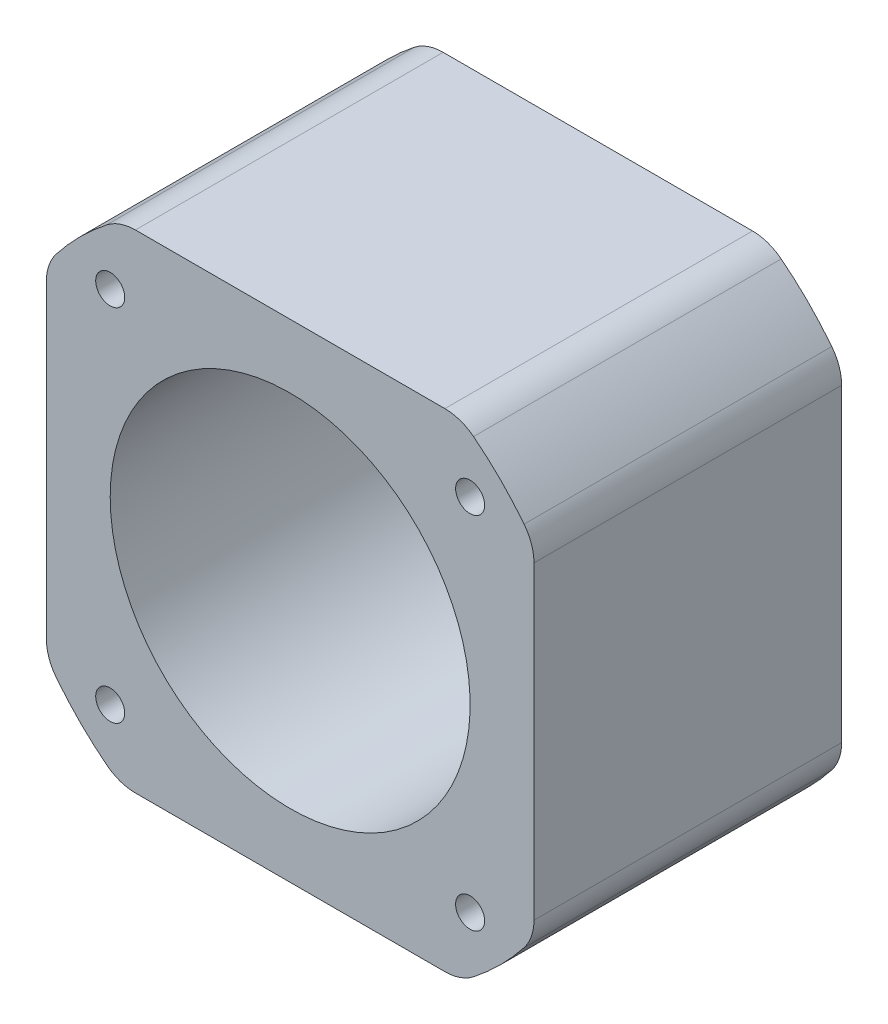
ISO-10303-21;
HEADER;
FILE_DESCRIPTION(('STEP AP214'),'2;1');
FILE_NAME('part.step','',(''),(''),'','','');
FILE_SCHEMA(('AUTOMOTIVE_DESIGN { 1 0 10303 214 1 1 1 1 }'));
ENDSEC;
DATA;
#1=APPLICATION_CONTEXT('core data for automotive mechanical design processes');
#2=APPLICATION_PROTOCOL_DEFINITION('international standard','automotive_design',2000,#1);
#3=PRODUCT_CONTEXT('',#1,'mechanical');
#4=PRODUCT('Part','Part','',(#3));
#5=PRODUCT_RELATED_PRODUCT_CATEGORY('part','',(#4));
#6=PRODUCT_DEFINITION_FORMATION('','',#4);
#7=PRODUCT_DEFINITION_CONTEXT('part definition',#1,'design');
#8=PRODUCT_DEFINITION('design','',#6,#7);
#9=PRODUCT_DEFINITION_SHAPE('','',#8);
#10=(LENGTH_UNIT() NAMED_UNIT(*) SI_UNIT(.MILLI.,.METRE.));
#11=(NAMED_UNIT(*) PLANE_ANGLE_UNIT() SI_UNIT($,.RADIAN.));
#12=(NAMED_UNIT(*) SI_UNIT($,.STERADIAN.) SOLID_ANGLE_UNIT());
#13=UNCERTAINTY_MEASURE_WITH_UNIT(LENGTH_MEASURE(1.E-05),#10,'distance_accuracy_value','');
#14=(GEOMETRIC_REPRESENTATION_CONTEXT(3) GLOBAL_UNCERTAINTY_ASSIGNED_CONTEXT((#13)) GLOBAL_UNIT_ASSIGNED_CONTEXT((#10,
#11,#12)) REPRESENTATION_CONTEXT('',''));
#15=CARTESIAN_POINT('',(0.,0.,0.));
#16=DIRECTION('',(0.,0.,1.));
#17=DIRECTION('',(1.,0.,0.));
#18=AXIS2_PLACEMENT_3D('',#15,#16,#17);
#19=CARTESIAN_POINT('',(-23.7206667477,121.617151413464,7.69999999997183));
#20=DIRECTION('',(0.,0.,1.));
#21=DIRECTION('',(1.,0.,0.));
#22=AXIS2_PLACEMENT_3D('',#19,#20,#21);
#23=CYLINDRICAL_SURFACE('',#22,4.00000000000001);
#24=CARTESIAN_POINT('',(-23.7206667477,121.617151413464,34.1999999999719));
#25=DIRECTION('',(0.,0.,1.));
#26=DIRECTION('',(1.,0.,0.));
#27=AXIS2_PLACEMENT_3D('',#24,#25,#26);
#28=CIRCLE('',#27,4.00000000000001);
#29=CARTESIAN_POINT('',(-23.7206667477,125.617151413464,34.1999999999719));
#30=VERTEX_POINT('',#29);
#31=CARTESIAN_POINT('',(-26.1882897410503,124.765299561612,34.1999999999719));
#32=VERTEX_POINT('',#31);
#33=EDGE_CURVE('E178',#30,#32,#28,.T.);
#34=ORIENTED_EDGE('',*,*,#33,.F.);
#35=DIRECTION('',(0.,0.,1.));
#36=VECTOR('',#35,1.);
#37=CARTESIAN_POINT('',(-23.7206667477,125.617151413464,7.69999999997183));
#38=LINE('',#37,#36);
#39=CARTESIAN_POINT('',(-23.7206667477,125.617151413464,7.69999999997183));
#40=VERTEX_POINT('',#39);
#41=EDGE_CURVE('E11',#40,#30,#38,.T.);
#42=ORIENTED_EDGE('',*,*,#41,.F.);
#43=CARTESIAN_POINT('',(-23.7206667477,121.617151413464,7.69999999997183));
#44=DIRECTION('',(0.,0.,1.));
#45=DIRECTION('',(1.,0.,0.));
#46=AXIS2_PLACEMENT_3D('',#43,#44,#45);
#47=CIRCLE('',#46,4.00000000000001);
#48=CARTESIAN_POINT('',(-26.1882897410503,124.765299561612,7.69999999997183));
#49=VERTEX_POINT('',#48);
#50=EDGE_CURVE('E223',#40,#49,#47,.T.);
#51=ORIENTED_EDGE('',*,*,#50,.T.);
#52=DIRECTION('',(0.,0.,1.));
#53=VECTOR('',#52,1.);
#54=CARTESIAN_POINT('',(-26.1882897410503,124.765299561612,7.69999999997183));
#55=LINE('',#54,#53);
#56=EDGE_CURVE('E36',#49,#32,#55,.T.);
#57=ORIENTED_EDGE('',*,*,#56,.T.);
#58=EDGE_LOOP('',(#34,#42,#51,#57));
#59=FACE_BOUND('',#58,.T.);
#60=ADVANCED_FACE('F33',(#59),#23,.T.);
#61=CARTESIAN_POINT('',(2.92966158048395,125.617151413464,7.69999999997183));
#62=DIRECTION('',(0.,1.,0.));
#63=DIRECTION('',(0.,0.,1.));
#64=AXIS2_PLACEMENT_3D('',#61,#62,#63);
#65=PLANE('',#64);
#66=DIRECTION('',(-1.,0.,0.));
#67=VECTOR('',#66,1.);
#68=CARTESIAN_POINT('',(2.92966158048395,125.617151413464,34.1999999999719));
#69=LINE('',#68,#67);
#70=CARTESIAN_POINT('',(2.92966158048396,125.617151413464,34.1999999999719));
#71=VERTEX_POINT('',#70);
#72=EDGE_CURVE('E221',#71,#30,#69,.T.);
#73=ORIENTED_EDGE('',*,*,#72,.F.);
#74=DIRECTION('',(0.,0.,1.));
#75=VECTOR('',#74,1.);
#76=CARTESIAN_POINT('',(2.92966158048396,125.617151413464,7.69999999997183));
#77=LINE('',#76,#75);
#78=CARTESIAN_POINT('',(2.92966158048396,125.617151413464,7.69999999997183));
#79=VERTEX_POINT('',#78);
#80=EDGE_CURVE('E42',#79,#71,#77,.T.);
#81=ORIENTED_EDGE('',*,*,#80,.F.);
#82=DIRECTION('',(-1.,0.,0.));
#83=VECTOR('',#82,1.);
#84=CARTESIAN_POINT('',(2.92966158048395,125.617151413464,7.69999999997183));
#85=LINE('',#84,#83);
#86=EDGE_CURVE('E168',#79,#40,#85,.T.);
#87=ORIENTED_EDGE('',*,*,#86,.T.);
#88=ORIENTED_EDGE('',*,*,#41,.T.);
#89=EDGE_LOOP('',(#73,#81,#87,#88));
#90=FACE_BOUND('',#89,.T.);
#91=ADVANCED_FACE('F251',(#90),#65,.T.);
#92=CARTESIAN_POINT('',(2.92966158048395,121.617151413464,7.69999999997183));
#93=DIRECTION('',(0.,0.,1.));
#94=DIRECTION('',(1.,0.,0.));
#95=AXIS2_PLACEMENT_3D('',#92,#93,#94);
#96=CYLINDRICAL_SURFACE('',#95,4.00000000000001);
#97=CARTESIAN_POINT('',(2.92966158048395,121.617151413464,34.1999999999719));
#98=DIRECTION('',(0.,0.,1.));
#99=DIRECTION('',(1.,0.,0.));
#100=AXIS2_PLACEMENT_3D('',#97,#98,#99);
#101=CIRCLE('',#100,4.00000000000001);
#102=CARTESIAN_POINT('',(5.39728457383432,124.765299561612,34.1999999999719));
#103=VERTEX_POINT('',#102);
#104=EDGE_CURVE('E155',#103,#71,#101,.T.);
#105=ORIENTED_EDGE('',*,*,#104,.F.);
#106=DIRECTION('',(0.,0.,1.));
#107=VECTOR('',#106,1.);
#108=CARTESIAN_POINT('',(5.39728457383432,124.765299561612,7.69999999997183));
#109=LINE('',#108,#107);
#110=CARTESIAN_POINT('',(5.39728457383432,124.765299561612,7.69999999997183));
#111=VERTEX_POINT('',#110);
#112=EDGE_CURVE('E150',#111,#103,#109,.T.);
#113=ORIENTED_EDGE('',*,*,#112,.F.);
#114=CARTESIAN_POINT('',(2.92966158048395,121.617151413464,7.69999999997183));
#115=DIRECTION('',(0.,0.,1.));
#116=DIRECTION('',(1.,0.,0.));
#117=AXIS2_PLACEMENT_3D('',#114,#115,#116);
#118=CIRCLE('',#117,4.00000000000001);
#119=EDGE_CURVE('E153',#111,#79,#118,.T.);
#120=ORIENTED_EDGE('',*,*,#119,.T.);
#121=ORIENTED_EDGE('',*,*,#80,.T.);
#122=EDGE_LOOP('',(#105,#113,#120,#121));
#123=FACE_BOUND('',#122,.T.);
#124=ADVANCED_FACE('F152',(#123),#96,.T.);
#125=CARTESIAN_POINT('',(-10.395502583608,104.617151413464,7.69999999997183));
#126=DIRECTION('',(0.,0.,1.));
#127=DIRECTION('',(1.,0.,0.));
#128=AXIS2_PLACEMENT_3D('',#125,#126,#127);
#129=CYLINDRICAL_SURFACE('',#128,25.6000000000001);
#130=CARTESIAN_POINT('',(-10.395502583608,104.617151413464,34.1999999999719));
#131=DIRECTION('',(0.,0.,1.));
#132=DIRECTION('',(1.,0.,0.));
#133=AXIS2_PLACEMENT_3D('',#130,#131,#132);
#134=CIRCLE('',#133,25.6000000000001);
#135=CARTESIAN_POINT('',(9.75264556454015,120.409938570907,34.1999999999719));
#136=VERTEX_POINT('',#135);
#137=EDGE_CURVE('E218',#136,#103,#134,.T.);
#138=ORIENTED_EDGE('',*,*,#137,.F.);
#139=DIRECTION('',(0.,0.,1.));
#140=VECTOR('',#139,1.);
#141=CARTESIAN_POINT('',(9.75264556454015,120.409938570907,7.69999999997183));
#142=LINE('',#141,#140);
#143=CARTESIAN_POINT('',(9.75264556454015,120.409938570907,7.69999999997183));
#144=VERTEX_POINT('',#143);
#145=EDGE_CURVE('E160',#144,#136,#142,.T.);
#146=ORIENTED_EDGE('',*,*,#145,.F.);
#147=CARTESIAN_POINT('',(-10.395502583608,104.617151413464,7.69999999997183));
#148=DIRECTION('',(0.,0.,1.));
#149=DIRECTION('',(1.,0.,0.));
#150=AXIS2_PLACEMENT_3D('',#147,#148,#149);
#151=CIRCLE('',#150,25.6000000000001);
#152=EDGE_CURVE('E166',#144,#111,#151,.T.);
#153=ORIENTED_EDGE('',*,*,#152,.T.);
#154=ORIENTED_EDGE('',*,*,#112,.T.);
#155=EDGE_LOOP('',(#138,#146,#153,#154));
#156=FACE_BOUND('',#155,.T.);
#157=ADVANCED_FACE('F170',(#156),#129,.T.);
#158=CARTESIAN_POINT('',(6.60449741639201,117.942315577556,7.69999999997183));
#159=DIRECTION('',(0.,0.,1.));
#160=DIRECTION('',(1.,0.,0.));
#161=AXIS2_PLACEMENT_3D('',#158,#159,#160);
#162=CYLINDRICAL_SURFACE('',#161,4.00000000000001);
#163=CARTESIAN_POINT('',(6.60449741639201,117.942315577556,34.1999999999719));
#164=DIRECTION('',(0.,0.,1.));
#165=DIRECTION('',(1.,0.,0.));
#166=AXIS2_PLACEMENT_3D('',#163,#164,#165);
#167=CIRCLE('',#166,4.00000000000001);
#168=CARTESIAN_POINT('',(10.604497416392,117.942315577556,34.1999999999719));
#169=VERTEX_POINT('',#168);
#170=EDGE_CURVE('E215',#169,#136,#167,.T.);
#171=ORIENTED_EDGE('',*,*,#170,.F.);
#172=DIRECTION('',(0.,0.,1.));
#173=VECTOR('',#172,1.);
#174=CARTESIAN_POINT('',(10.604497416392,117.942315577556,7.69999999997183));
#175=LINE('',#174,#173);
#176=CARTESIAN_POINT('',(10.604497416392,117.942315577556,7.69999999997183));
#177=VERTEX_POINT('',#176);
#178=EDGE_CURVE('E227',#177,#169,#175,.T.);
#179=ORIENTED_EDGE('',*,*,#178,.F.);
#180=CARTESIAN_POINT('',(6.60449741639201,117.942315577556,7.69999999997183));
#181=DIRECTION('',(0.,0.,1.));
#182=DIRECTION('',(1.,0.,0.));
#183=AXIS2_PLACEMENT_3D('',#180,#181,#182);
#184=CIRCLE('',#183,4.00000000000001);
#185=EDGE_CURVE('E171',#177,#144,#184,.T.);
#186=ORIENTED_EDGE('',*,*,#185,.T.);
#187=ORIENTED_EDGE('',*,*,#145,.T.);
#188=EDGE_LOOP('',(#171,#179,#186,#187));
#189=FACE_BOUND('',#188,.T.);
#190=ADVANCED_FACE('F264',(#189),#162,.T.);
#191=CARTESIAN_POINT('',(10.604497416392,91.2919872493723,7.69999999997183));
#192=DIRECTION('',(1.,0.,0.));
#193=DIRECTION('',(0.,0.,-1.));
#194=AXIS2_PLACEMENT_3D('',#191,#192,#193);
#195=PLANE('',#194);
#196=DIRECTION('',(0.,1.,0.));
#197=VECTOR('',#196,1.);
#198=CARTESIAN_POINT('',(10.604497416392,91.2919872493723,34.1999999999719));
#199=LINE('',#198,#197);
#200=CARTESIAN_POINT('',(10.604497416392,91.2919872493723,34.1999999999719));
#201=VERTEX_POINT('',#200);
#202=EDGE_CURVE('E212',#201,#169,#199,.T.);
#203=ORIENTED_EDGE('',*,*,#202,.F.);
#204=DIRECTION('',(0.,0.,1.));
#205=VECTOR('',#204,1.);
#206=CARTESIAN_POINT('',(10.604497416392,91.2919872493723,7.69999999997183));
#207=LINE('',#206,#205);
#208=CARTESIAN_POINT('',(10.604497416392,91.2919872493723,7.69999999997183));
#209=VERTEX_POINT('',#208);
#210=EDGE_CURVE('E229',#209,#201,#207,.T.);
#211=ORIENTED_EDGE('',*,*,#210,.F.);
#212=DIRECTION('',(0.,1.,0.));
#213=VECTOR('',#212,1.);
#214=CARTESIAN_POINT('',(10.604497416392,91.2919872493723,7.69999999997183));
#215=LINE('',#214,#213);
#216=EDGE_CURVE('E173',#209,#177,#215,.T.);
#217=ORIENTED_EDGE('',*,*,#216,.T.);
#218=ORIENTED_EDGE('',*,*,#178,.T.);
#219=EDGE_LOOP('',(#203,#211,#217,#218));
#220=FACE_BOUND('',#219,.T.);
#221=ADVANCED_FACE('F267',(#220),#195,.T.);
#222=CARTESIAN_POINT('',(6.60449741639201,91.2919872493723,7.69999999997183));
#223=DIRECTION('',(0.,0.,1.));
#224=DIRECTION('',(1.,0.,0.));
#225=AXIS2_PLACEMENT_3D('',#222,#223,#224);
#226=CYLINDRICAL_SURFACE('',#225,3.99999999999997);
#227=CARTESIAN_POINT('',(6.60449741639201,91.2919872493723,34.1999999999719));
#228=DIRECTION('',(0.,0.,1.));
#229=DIRECTION('',(1.,0.,0.));
#230=AXIS2_PLACEMENT_3D('',#227,#228,#229);
#231=CIRCLE('',#230,3.99999999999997);
#232=CARTESIAN_POINT('',(9.75264556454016,88.824364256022,34.1999999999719));
#233=VERTEX_POINT('',#232);
#234=EDGE_CURVE('E209',#233,#201,#231,.T.);
#235=ORIENTED_EDGE('',*,*,#234,.F.);
#236=DIRECTION('',(0.,0.,1.));
#237=VECTOR('',#236,1.);
#238=CARTESIAN_POINT('',(9.75264556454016,88.824364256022,7.69999999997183));
#239=LINE('',#238,#237);
#240=CARTESIAN_POINT('',(9.75264556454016,88.824364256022,7.69999999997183));
#241=VERTEX_POINT('',#240);
#242=EDGE_CURVE('E231',#241,#233,#239,.T.);
#243=ORIENTED_EDGE('',*,*,#242,.F.);
#244=CARTESIAN_POINT('',(6.60449741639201,91.2919872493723,7.69999999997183));
#245=DIRECTION('',(0.,0.,1.));
#246=DIRECTION('',(1.,0.,0.));
#247=AXIS2_PLACEMENT_3D('',#244,#245,#246);
#248=CIRCLE('',#247,3.99999999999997);
#249=EDGE_CURVE('E399',#241,#209,#248,.T.);
#250=ORIENTED_EDGE('',*,*,#249,.T.);
#251=ORIENTED_EDGE('',*,*,#210,.T.);
#252=EDGE_LOOP('',(#235,#243,#250,#251));
#253=FACE_BOUND('',#252,.T.);
#254=ADVANCED_FACE('F271',(#253),#226,.T.);
#255=CARTESIAN_POINT('',(-10.395502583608,104.617151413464,7.69999999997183));
#256=DIRECTION('',(0.,0.,1.));
#257=DIRECTION('',(1.,0.,0.));
#258=AXIS2_PLACEMENT_3D('',#255,#256,#257);
#259=CYLINDRICAL_SURFACE('',#258,25.6);
#260=CARTESIAN_POINT('',(-10.395502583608,104.617151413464,34.1999999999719));
#261=DIRECTION('',(0.,0.,1.));
#262=DIRECTION('',(1.,0.,0.));
#263=AXIS2_PLACEMENT_3D('',#260,#261,#262);
#264=CIRCLE('',#263,25.6);
#265=CARTESIAN_POINT('',(5.39728457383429,84.4690032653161,34.1999999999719));
#266=VERTEX_POINT('',#265);
#267=EDGE_CURVE('E206',#266,#233,#264,.T.);
#268=ORIENTED_EDGE('',*,*,#267,.F.);
#269=DIRECTION('',(0.,0.,1.));
#270=VECTOR('',#269,1.);
#271=CARTESIAN_POINT('',(5.39728457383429,84.4690032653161,7.69999999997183));
#272=LINE('',#271,#270);
#273=CARTESIAN_POINT('',(5.39728457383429,84.4690032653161,7.69999999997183));
#274=VERTEX_POINT('',#273);
#275=EDGE_CURVE('E233',#274,#266,#272,.T.);
#276=ORIENTED_EDGE('',*,*,#275,.F.);
#277=CARTESIAN_POINT('',(-10.395502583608,104.617151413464,7.69999999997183));
#278=DIRECTION('',(0.,0.,1.));
#279=DIRECTION('',(1.,0.,0.));
#280=AXIS2_PLACEMENT_3D('',#277,#278,#279);
#281=CIRCLE('',#280,25.6);
#282=EDGE_CURVE('E396',#274,#241,#281,.T.);
#283=ORIENTED_EDGE('',*,*,#282,.T.);
#284=ORIENTED_EDGE('',*,*,#242,.T.);
#285=EDGE_LOOP('',(#268,#276,#283,#284));
#286=FACE_BOUND('',#285,.T.);
#287=ADVANCED_FACE('F275',(#286),#259,.T.);
#288=CARTESIAN_POINT('',(2.92966158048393,87.6171514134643,7.69999999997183));
#289=DIRECTION('',(0.,0.,1.));
#290=DIRECTION('',(1.,0.,0.));
#291=AXIS2_PLACEMENT_3D('',#288,#289,#290);
#292=CYLINDRICAL_SURFACE('',#291,4.00000000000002);
#293=CARTESIAN_POINT('',(2.92966158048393,87.6171514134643,34.1999999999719));
#294=DIRECTION('',(0.,0.,1.));
#295=DIRECTION('',(1.,0.,0.));
#296=AXIS2_PLACEMENT_3D('',#293,#294,#295);
#297=CIRCLE('',#296,4.00000000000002);
#298=CARTESIAN_POINT('',(2.92966158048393,83.6171514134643,34.1999999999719));
#299=VERTEX_POINT('',#298);
#300=EDGE_CURVE('E203',#299,#266,#297,.T.);
#301=ORIENTED_EDGE('',*,*,#300,.F.);
#302=DIRECTION('',(0.,0.,1.));
#303=VECTOR('',#302,1.);
#304=CARTESIAN_POINT('',(2.92966158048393,83.6171514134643,7.69999999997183));
#305=LINE('',#304,#303);
#306=CARTESIAN_POINT('',(2.92966158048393,83.6171514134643,7.69999999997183));
#307=VERTEX_POINT('',#306);
#308=EDGE_CURVE('E235',#307,#299,#305,.T.);
#309=ORIENTED_EDGE('',*,*,#308,.F.);
#310=CARTESIAN_POINT('',(2.92966158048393,87.6171514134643,7.69999999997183));
#311=DIRECTION('',(0.,0.,1.));
#312=DIRECTION('',(1.,0.,0.));
#313=AXIS2_PLACEMENT_3D('',#310,#311,#312);
#314=CIRCLE('',#313,4.00000000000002);
#315=EDGE_CURVE('E393',#307,#274,#314,.T.);
#316=ORIENTED_EDGE('',*,*,#315,.T.);
#317=ORIENTED_EDGE('',*,*,#275,.T.);
#318=EDGE_LOOP('',(#301,#309,#316,#317));
#319=FACE_BOUND('',#318,.T.);
#320=ADVANCED_FACE('F279',(#319),#292,.T.);
#321=CARTESIAN_POINT('',(-23.7206667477,83.6171514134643,7.69999999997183));
#322=DIRECTION('',(0.,-1.,0.));
#323=DIRECTION('',(0.,0.,-1.));
#324=AXIS2_PLACEMENT_3D('',#321,#322,#323);
#325=PLANE('',#324);
#326=DIRECTION('',(1.,0.,0.));
#327=VECTOR('',#326,1.);
#328=CARTESIAN_POINT('',(-23.7206667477,83.6171514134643,34.1999999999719));
#329=LINE('',#328,#327);
#330=CARTESIAN_POINT('',(-23.7206667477,83.6171514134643,34.1999999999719));
#331=VERTEX_POINT('',#330);
#332=EDGE_CURVE('E200',#331,#299,#329,.T.);
#333=ORIENTED_EDGE('',*,*,#332,.F.);
#334=DIRECTION('',(0.,0.,1.));
#335=VECTOR('',#334,1.);
#336=CARTESIAN_POINT('',(-23.7206667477,83.6171514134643,7.69999999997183));
#337=LINE('',#336,#335);
#338=CARTESIAN_POINT('',(-23.7206667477,83.6171514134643,7.69999999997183));
#339=VERTEX_POINT('',#338);
#340=EDGE_CURVE('E237',#339,#331,#337,.T.);
#341=ORIENTED_EDGE('',*,*,#340,.F.);
#342=DIRECTION('',(1.,0.,0.));
#343=VECTOR('',#342,1.);
#344=CARTESIAN_POINT('',(-23.7206667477,83.6171514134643,7.69999999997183));
#345=LINE('',#344,#343);
#346=EDGE_CURVE('E390',#339,#307,#345,.T.);
#347=ORIENTED_EDGE('',*,*,#346,.T.);
#348=ORIENTED_EDGE('',*,*,#308,.T.);
#349=EDGE_LOOP('',(#333,#341,#347,#348));
#350=FACE_BOUND('',#349,.T.);
#351=ADVANCED_FACE('F283',(#350),#325,.T.);
#352=CARTESIAN_POINT('',(-23.7206667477,87.6171514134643,7.69999999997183));
#353=DIRECTION('',(0.,0.,1.));
#354=DIRECTION('',(1.,0.,0.));
#355=AXIS2_PLACEMENT_3D('',#352,#353,#354);
#356=CYLINDRICAL_SURFACE('',#355,4.00000000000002);
#357=CARTESIAN_POINT('',(-23.7206667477,87.6171514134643,34.1999999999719));
#358=DIRECTION('',(0.,0.,1.));
#359=DIRECTION('',(1.,0.,0.));
#360=AXIS2_PLACEMENT_3D('',#357,#358,#359);
#361=CIRCLE('',#360,4.00000000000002);
#362=CARTESIAN_POINT('',(-26.1882897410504,84.4690032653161,34.1999999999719));
#363=VERTEX_POINT('',#362);
#364=EDGE_CURVE('E197',#363,#331,#361,.T.);
#365=ORIENTED_EDGE('',*,*,#364,.F.);
#366=DIRECTION('',(0.,0.,1.));
#367=VECTOR('',#366,1.);
#368=CARTESIAN_POINT('',(-26.1882897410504,84.4690032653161,7.69999999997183));
#369=LINE('',#368,#367);
#370=CARTESIAN_POINT('',(-26.1882897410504,84.4690032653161,7.69999999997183));
#371=VERTEX_POINT('',#370);
#372=EDGE_CURVE('E239',#371,#363,#369,.T.);
#373=ORIENTED_EDGE('',*,*,#372,.F.);
#374=CARTESIAN_POINT('',(-23.7206667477,87.6171514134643,7.69999999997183));
#375=DIRECTION('',(0.,0.,1.));
#376=DIRECTION('',(1.,0.,0.));
#377=AXIS2_PLACEMENT_3D('',#374,#375,#376);
#378=CIRCLE('',#377,4.00000000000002);
#379=EDGE_CURVE('E387',#371,#339,#378,.T.);
#380=ORIENTED_EDGE('',*,*,#379,.T.);
#381=ORIENTED_EDGE('',*,*,#340,.T.);
#382=EDGE_LOOP('',(#365,#373,#380,#381));
#383=FACE_BOUND('',#382,.T.);
#384=ADVANCED_FACE('F287',(#383),#356,.T.);
#385=CARTESIAN_POINT('',(-10.395502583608,104.617151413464,7.69999999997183));
#386=DIRECTION('',(0.,0.,1.));
#387=DIRECTION('',(1.,0.,0.));
#388=AXIS2_PLACEMENT_3D('',#385,#386,#387);
#389=CYLINDRICAL_SURFACE('',#388,25.6);
#390=CARTESIAN_POINT('',(-10.395502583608,104.617151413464,34.1999999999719));
#391=DIRECTION('',(0.,0.,1.));
#392=DIRECTION('',(1.,0.,0.));
#393=AXIS2_PLACEMENT_3D('',#390,#391,#392);
#394=CIRCLE('',#393,25.6);
#395=CARTESIAN_POINT('',(-30.5436507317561,88.8243642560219,34.1999999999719));
#396=VERTEX_POINT('',#395);
#397=EDGE_CURVE('E194',#396,#363,#394,.T.);
#398=ORIENTED_EDGE('',*,*,#397,.F.);
#399=DIRECTION('',(0.,0.,1.));
#400=VECTOR('',#399,1.);
#401=CARTESIAN_POINT('',(-30.5436507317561,88.8243642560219,7.69999999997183));
#402=LINE('',#401,#400);
#403=CARTESIAN_POINT('',(-30.5436507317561,88.8243642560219,7.69999999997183));
#404=VERTEX_POINT('',#403);
#405=EDGE_CURVE('E241',#404,#396,#402,.T.);
#406=ORIENTED_EDGE('',*,*,#405,.F.);
#407=CARTESIAN_POINT('',(-10.395502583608,104.617151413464,7.69999999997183));
#408=DIRECTION('',(0.,0.,1.));
#409=DIRECTION('',(1.,0.,0.));
#410=AXIS2_PLACEMENT_3D('',#407,#408,#409);
#411=CIRCLE('',#410,25.6);
#412=EDGE_CURVE('E384',#404,#371,#411,.T.);
#413=ORIENTED_EDGE('',*,*,#412,.T.);
#414=ORIENTED_EDGE('',*,*,#372,.T.);
#415=EDGE_LOOP('',(#398,#406,#413,#414));
#416=FACE_BOUND('',#415,.T.);
#417=ADVANCED_FACE('F291',(#416),#389,.T.);
#418=CARTESIAN_POINT('',(-27.395502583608,91.2919872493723,7.69999999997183));
#419=DIRECTION('',(0.,0.,1.));
#420=DIRECTION('',(1.,0.,0.));
#421=AXIS2_PLACEMENT_3D('',#418,#419,#420);
#422=CYLINDRICAL_SURFACE('',#421,4.00000000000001);
#423=CARTESIAN_POINT('',(-27.395502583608,91.2919872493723,34.1999999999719));
#424=DIRECTION('',(0.,0.,1.));
#425=DIRECTION('',(1.,0.,0.));
#426=AXIS2_PLACEMENT_3D('',#423,#424,#425);
#427=CIRCLE('',#426,4.00000000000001);
#428=CARTESIAN_POINT('',(-31.395502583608,91.2919872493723,34.1999999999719));
#429=VERTEX_POINT('',#428);
#430=EDGE_CURVE('E191',#429,#396,#427,.T.);
#431=ORIENTED_EDGE('',*,*,#430,.F.);
#432=DIRECTION('',(0.,0.,1.));
#433=VECTOR('',#432,1.);
#434=CARTESIAN_POINT('',(-31.395502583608,91.2919872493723,7.69999999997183));
#435=LINE('',#434,#433);
#436=CARTESIAN_POINT('',(-31.395502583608,91.2919872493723,7.69999999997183));
#437=VERTEX_POINT('',#436);
#438=EDGE_CURVE('E243',#437,#429,#435,.T.);
#439=ORIENTED_EDGE('',*,*,#438,.F.);
#440=CARTESIAN_POINT('',(-27.395502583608,91.2919872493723,7.69999999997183));
#441=DIRECTION('',(0.,0.,1.));
#442=DIRECTION('',(1.,0.,0.));
#443=AXIS2_PLACEMENT_3D('',#440,#441,#442);
#444=CIRCLE('',#443,4.00000000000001);
#445=EDGE_CURVE('E381',#437,#404,#444,.T.);
#446=ORIENTED_EDGE('',*,*,#445,.T.);
#447=ORIENTED_EDGE('',*,*,#405,.T.);
#448=EDGE_LOOP('',(#431,#439,#446,#447));
#449=FACE_BOUND('',#448,.T.);
#450=ADVANCED_FACE('F295',(#449),#422,.T.);
#451=CARTESIAN_POINT('',(-31.395502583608,117.942315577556,7.69999999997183));
#452=DIRECTION('',(-1.,0.,0.));
#453=DIRECTION('',(0.,0.,1.));
#454=AXIS2_PLACEMENT_3D('',#451,#452,#453);
#455=PLANE('',#454);
#456=DIRECTION('',(0.,-1.,0.));
#457=VECTOR('',#456,1.);
#458=CARTESIAN_POINT('',(-31.395502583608,117.942315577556,34.1999999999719));
#459=LINE('',#458,#457);
#460=CARTESIAN_POINT('',(-31.395502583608,117.942315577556,34.1999999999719));
#461=VERTEX_POINT('',#460);
#462=EDGE_CURVE('E188',#461,#429,#459,.T.);
#463=ORIENTED_EDGE('',*,*,#462,.F.);
#464=DIRECTION('',(0.,0.,1.));
#465=VECTOR('',#464,1.);
#466=CARTESIAN_POINT('',(-31.395502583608,117.942315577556,7.69999999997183));
#467=LINE('',#466,#465);
#468=CARTESIAN_POINT('',(-31.395502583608,117.942315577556,7.69999999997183));
#469=VERTEX_POINT('',#468);
#470=EDGE_CURVE('E245',#469,#461,#467,.T.);
#471=ORIENTED_EDGE('',*,*,#470,.F.);
#472=DIRECTION('',(0.,-1.,0.));
#473=VECTOR('',#472,1.);
#474=CARTESIAN_POINT('',(-31.395502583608,117.942315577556,7.69999999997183));
#475=LINE('',#474,#473);
#476=EDGE_CURVE('E378',#469,#437,#475,.T.);
#477=ORIENTED_EDGE('',*,*,#476,.T.);
#478=ORIENTED_EDGE('',*,*,#438,.T.);
#479=EDGE_LOOP('',(#463,#471,#477,#478));
#480=FACE_BOUND('',#479,.T.);
#481=ADVANCED_FACE('F299',(#480),#455,.T.);
#482=CARTESIAN_POINT('',(-27.395502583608,117.942315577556,7.69999999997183));
#483=DIRECTION('',(0.,0.,1.));
#484=DIRECTION('',(1.,0.,0.));
#485=AXIS2_PLACEMENT_3D('',#482,#483,#484);
#486=CYLINDRICAL_SURFACE('',#485,4.00000000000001);
#487=CARTESIAN_POINT('',(-27.395502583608,117.942315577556,34.1999999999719));
#488=DIRECTION('',(0.,0.,1.));
#489=DIRECTION('',(1.,0.,0.));
#490=AXIS2_PLACEMENT_3D('',#487,#488,#489);
#491=CIRCLE('',#490,4.00000000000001);
#492=CARTESIAN_POINT('',(-30.5436507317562,120.409938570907,34.1999999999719));
#493=VERTEX_POINT('',#492);
#494=EDGE_CURVE('E185',#493,#461,#491,.T.);
#495=ORIENTED_EDGE('',*,*,#494,.F.);
#496=DIRECTION('',(0.,0.,1.));
#497=VECTOR('',#496,1.);
#498=CARTESIAN_POINT('',(-30.5436507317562,120.409938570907,7.69999999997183));
#499=LINE('',#498,#497);
#500=CARTESIAN_POINT('',(-30.5436507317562,120.409938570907,7.69999999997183));
#501=VERTEX_POINT('',#500);
#502=EDGE_CURVE('E246',#501,#493,#499,.T.);
#503=ORIENTED_EDGE('',*,*,#502,.F.);
#504=CARTESIAN_POINT('',(-27.395502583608,117.942315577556,7.69999999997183));
#505=DIRECTION('',(0.,0.,1.));
#506=DIRECTION('',(1.,0.,0.));
#507=AXIS2_PLACEMENT_3D('',#504,#505,#506);
#508=CIRCLE('',#507,4.00000000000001);
#509=EDGE_CURVE('E375',#501,#469,#508,.T.);
#510=ORIENTED_EDGE('',*,*,#509,.T.);
#511=ORIENTED_EDGE('',*,*,#470,.T.);
#512=EDGE_LOOP('',(#495,#503,#510,#511));
#513=FACE_BOUND('',#512,.T.);
#514=ADVANCED_FACE('F303',(#513),#486,.T.);
#515=CARTESIAN_POINT('',(-10.395502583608,104.617151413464,7.69999999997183));
#516=DIRECTION('',(0.,0.,1.));
#517=DIRECTION('',(1.,0.,0.));
#518=AXIS2_PLACEMENT_3D('',#515,#516,#517);
#519=CYLINDRICAL_SURFACE('',#518,25.6000000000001);
#520=CARTESIAN_POINT('',(-10.395502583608,104.617151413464,34.1999999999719));
#521=DIRECTION('',(0.,0.,1.));
#522=DIRECTION('',(1.,0.,0.));
#523=AXIS2_PLACEMENT_3D('',#520,#521,#522);
#524=CIRCLE('',#523,25.6000000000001);
#525=EDGE_CURVE('E181',#32,#493,#524,.T.);
#526=ORIENTED_EDGE('',*,*,#525,.F.);
#527=ORIENTED_EDGE('',*,*,#56,.F.);
#528=CARTESIAN_POINT('',(-10.395502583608,104.617151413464,7.69999999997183));
#529=DIRECTION('',(0.,0.,1.));
#530=DIRECTION('',(1.,0.,0.));
#531=AXIS2_PLACEMENT_3D('',#528,#529,#530);
#532=CIRCLE('',#531,25.6000000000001);
#533=EDGE_CURVE('E373',#49,#501,#532,.T.);
#534=ORIENTED_EDGE('',*,*,#533,.T.);
#535=ORIENTED_EDGE('',*,*,#502,.T.);
#536=EDGE_LOOP('',(#526,#527,#534,#535));
#537=FACE_BOUND('',#536,.T.);
#538=ADVANCED_FACE('F248',(#537),#519,.T.);
#539=CARTESIAN_POINT('',(-23.7206667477,121.617151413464,7.69999999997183));
#540=DIRECTION('',(0.,0.,1.));
#541=DIRECTION('',(1.,0.,0.));
#542=AXIS2_PLACEMENT_3D('',#539,#540,#541);
#543=PLANE('',#542);
#544=CARTESIAN_POINT('',(-25.895502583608,89.1171514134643,7.69999999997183));
#545=DIRECTION('',(0.,0.,1.));
#546=DIRECTION('',(-1.,0.,0.));
#547=AXIS2_PLACEMENT_3D('',#544,#545,#546);
#548=CIRCLE('',#547,1.25);
#549=CARTESIAN_POINT('',(-27.145502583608,89.1171514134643,7.69999999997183));
#550=VERTEX_POINT('',#549);
#551=EDGE_CURVE('E342',#550,#550,#548,.T.);
#552=ORIENTED_EDGE('',*,*,#551,.T.);
#553=EDGE_LOOP('',(#552));
#554=FACE_BOUND('',#553,.T.);
#555=CARTESIAN_POINT('',(5.10449741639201,120.117151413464,7.69999999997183));
#556=DIRECTION('',(0.,0.,1.));
#557=DIRECTION('',(-1.,0.,0.));
#558=AXIS2_PLACEMENT_3D('',#555,#556,#557);
#559=CIRCLE('',#558,1.25000000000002);
#560=CARTESIAN_POINT('',(3.85449741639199,120.117151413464,7.69999999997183));
#561=VERTEX_POINT('',#560);
#562=EDGE_CURVE('E350',#561,#561,#559,.T.);
#563=ORIENTED_EDGE('',*,*,#562,.T.);
#564=EDGE_LOOP('',(#563));
#565=FACE_BOUND('',#564,.T.);
#566=CARTESIAN_POINT('',(-10.395502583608,104.617151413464,7.69999999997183));
#567=DIRECTION('',(0.,0.,1.));
#568=DIRECTION('',(-1.,0.,0.));
#569=AXIS2_PLACEMENT_3D('',#566,#567,#568);
#570=CIRCLE('',#569,15.5);
#571=CARTESIAN_POINT('',(-25.895502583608,104.617151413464,7.69999999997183));
#572=VERTEX_POINT('',#571);
#573=EDGE_CURVE('E356',#572,#572,#570,.T.);
#574=ORIENTED_EDGE('',*,*,#573,.T.);
#575=EDGE_LOOP('',(#574));
#576=FACE_BOUND('',#575,.T.);
#577=CARTESIAN_POINT('',(-25.895502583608,120.117151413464,7.69999999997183));
#578=DIRECTION('',(0.,0.,1.));
#579=DIRECTION('',(-1.,0.,0.));
#580=AXIS2_PLACEMENT_3D('',#577,#578,#579);
#581=CIRCLE('',#580,1.25000000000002);
#582=CARTESIAN_POINT('',(-27.145502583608,120.117151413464,7.69999999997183));
#583=VERTEX_POINT('',#582);
#584=EDGE_CURVE('E362',#583,#583,#581,.T.);
#585=ORIENTED_EDGE('',*,*,#584,.T.);
#586=EDGE_LOOP('',(#585));
#587=FACE_BOUND('',#586,.T.);
#588=CARTESIAN_POINT('',(5.10449741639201,89.1171514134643,7.69999999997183));
#589=DIRECTION('',(0.,0.,1.));
#590=DIRECTION('',(-1.,0.,0.));
#591=AXIS2_PLACEMENT_3D('',#588,#589,#590);
#592=CIRCLE('',#591,1.25000000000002);
#593=CARTESIAN_POINT('',(3.85449741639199,89.1171514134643,7.69999999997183));
#594=VERTEX_POINT('',#593);
#595=EDGE_CURVE('E182',#594,#594,#592,.T.);
#596=ORIENTED_EDGE('',*,*,#595,.T.);
#597=EDGE_LOOP('',(#596));
#598=FACE_BOUND('',#597,.T.);
#599=ORIENTED_EDGE('',*,*,#50,.F.);
#600=ORIENTED_EDGE('',*,*,#86,.F.);
#601=ORIENTED_EDGE('',*,*,#119,.F.);
#602=ORIENTED_EDGE('',*,*,#152,.F.);
#603=ORIENTED_EDGE('',*,*,#185,.F.);
#604=ORIENTED_EDGE('',*,*,#216,.F.);
#605=ORIENTED_EDGE('',*,*,#249,.F.);
#606=ORIENTED_EDGE('',*,*,#282,.F.);
#607=ORIENTED_EDGE('',*,*,#315,.F.);
#608=ORIENTED_EDGE('',*,*,#346,.F.);
#609=ORIENTED_EDGE('',*,*,#379,.F.);
#610=ORIENTED_EDGE('',*,*,#412,.F.);
#611=ORIENTED_EDGE('',*,*,#445,.F.);
#612=ORIENTED_EDGE('',*,*,#476,.F.);
#613=ORIENTED_EDGE('',*,*,#509,.F.);
#614=ORIENTED_EDGE('',*,*,#533,.F.);
#615=EDGE_LOOP('',(#599,#600,#601,#602,#603,#604,#605,#606,#607,#608,#609,#610,#611,#612,#613,#614));
#616=FACE_BOUND('',#615,.T.);
#617=ADVANCED_FACE('F164',(#554,#565,#576,#587,#598,#616),#543,.F.);
#618=CARTESIAN_POINT('',(-23.7206667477,121.617151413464,34.1999999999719));
#619=DIRECTION('',(0.,0.,1.));
#620=DIRECTION('',(1.,0.,0.));
#621=AXIS2_PLACEMENT_3D('',#618,#619,#620);
#622=PLANE('',#621);
#623=CARTESIAN_POINT('',(-25.895502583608,89.1171514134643,34.1999999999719));
#624=DIRECTION('',(0.,0.,1.));
#625=DIRECTION('',(-1.,0.,0.));
#626=AXIS2_PLACEMENT_3D('',#623,#624,#625);
#627=CIRCLE('',#626,1.25);
#628=CARTESIAN_POINT('',(-27.145502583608,89.1171514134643,34.1999999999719));
#629=VERTEX_POINT('',#628);
#630=EDGE_CURVE('E345',#629,#629,#627,.T.);
#631=ORIENTED_EDGE('',*,*,#630,.F.);
#632=EDGE_LOOP('',(#631));
#633=FACE_BOUND('',#632,.T.);
#634=CARTESIAN_POINT('',(5.10449741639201,120.117151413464,34.1999999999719));
#635=DIRECTION('',(0.,0.,1.));
#636=DIRECTION('',(-1.,0.,0.));
#637=AXIS2_PLACEMENT_3D('',#634,#635,#636);
#638=CIRCLE('',#637,1.25000000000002);
#639=CARTESIAN_POINT('',(3.85449741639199,120.117151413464,34.1999999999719));
#640=VERTEX_POINT('',#639);
#641=EDGE_CURVE('E347',#640,#640,#638,.T.);
#642=ORIENTED_EDGE('',*,*,#641,.F.);
#643=EDGE_LOOP('',(#642));
#644=FACE_BOUND('',#643,.T.);
#645=CARTESIAN_POINT('',(-10.395502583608,104.617151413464,34.1999999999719));
#646=DIRECTION('',(0.,0.,1.));
#647=DIRECTION('',(-1.,0.,0.));
#648=AXIS2_PLACEMENT_3D('',#645,#646,#647);
#649=CIRCLE('',#648,15.5);
#650=CARTESIAN_POINT('',(-25.895502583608,104.617151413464,34.1999999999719));
#651=VERTEX_POINT('',#650);
#652=EDGE_CURVE('E353',#651,#651,#649,.T.);
#653=ORIENTED_EDGE('',*,*,#652,.F.);
#654=EDGE_LOOP('',(#653));
#655=FACE_BOUND('',#654,.T.);
#656=CARTESIAN_POINT('',(-25.895502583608,120.117151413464,34.1999999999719));
#657=DIRECTION('',(0.,0.,1.));
#658=DIRECTION('',(-1.,0.,0.));
#659=AXIS2_PLACEMENT_3D('',#656,#657,#658);
#660=CIRCLE('',#659,1.25000000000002);
#661=CARTESIAN_POINT('',(-27.145502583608,120.117151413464,34.1999999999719));
#662=VERTEX_POINT('',#661);
#663=EDGE_CURVE('E359',#662,#662,#660,.T.);
#664=ORIENTED_EDGE('',*,*,#663,.F.);
#665=EDGE_LOOP('',(#664));
#666=FACE_BOUND('',#665,.T.);
#667=CARTESIAN_POINT('',(5.10449741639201,89.1171514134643,34.1999999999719));
#668=DIRECTION('',(0.,0.,1.));
#669=DIRECTION('',(-1.,0.,0.));
#670=AXIS2_PLACEMENT_3D('',#667,#668,#669);
#671=CIRCLE('',#670,1.25000000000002);
#672=CARTESIAN_POINT('',(3.85449741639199,89.1171514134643,34.1999999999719));
#673=VERTEX_POINT('',#672);
#674=EDGE_CURVE('E365',#673,#673,#671,.T.);
#675=ORIENTED_EDGE('',*,*,#674,.F.);
#676=EDGE_LOOP('',(#675));
#677=FACE_BOUND('',#676,.T.);
#678=ORIENTED_EDGE('',*,*,#33,.T.);
#679=ORIENTED_EDGE('',*,*,#525,.T.);
#680=ORIENTED_EDGE('',*,*,#494,.T.);
#681=ORIENTED_EDGE('',*,*,#462,.T.);
#682=ORIENTED_EDGE('',*,*,#430,.T.);
#683=ORIENTED_EDGE('',*,*,#397,.T.);
#684=ORIENTED_EDGE('',*,*,#364,.T.);
#685=ORIENTED_EDGE('',*,*,#332,.T.);
#686=ORIENTED_EDGE('',*,*,#300,.T.);
#687=ORIENTED_EDGE('',*,*,#267,.T.);
#688=ORIENTED_EDGE('',*,*,#234,.T.);
#689=ORIENTED_EDGE('',*,*,#202,.T.);
#690=ORIENTED_EDGE('',*,*,#170,.T.);
#691=ORIENTED_EDGE('',*,*,#137,.T.);
#692=ORIENTED_EDGE('',*,*,#104,.T.);
#693=ORIENTED_EDGE('',*,*,#72,.T.);
#694=EDGE_LOOP('',(#678,#679,#680,#681,#682,#683,#684,#685,#686,#687,#688,#689,#690,#691,#692,#693));
#695=FACE_BOUND('',#694,.T.);
#696=ADVANCED_FACE('F250',(#633,#644,#655,#666,#677,#695),#622,.T.);
#697=CARTESIAN_POINT('',(5.10449741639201,89.1171514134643,7.69999999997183));
#698=DIRECTION('',(0.,0.,1.));
#699=DIRECTION('',(1.,0.,0.));
#700=AXIS2_PLACEMENT_3D('',#697,#698,#699);
#701=CYLINDRICAL_SURFACE('',#700,1.25000000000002);
#702=ORIENTED_EDGE('',*,*,#595,.F.);
#703=EDGE_LOOP('',(#702));
#704=FACE_BOUND('',#703,.T.);
#705=ORIENTED_EDGE('',*,*,#674,.T.);
#706=EDGE_LOOP('',(#705));
#707=FACE_BOUND('',#706,.T.);
#708=ADVANCED_FACE('F315',(#704,#707),#701,.F.);
#709=CARTESIAN_POINT('',(-25.895502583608,120.117151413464,7.69999999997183));
#710=DIRECTION('',(0.,0.,1.));
#711=DIRECTION('',(1.,0.,0.));
#712=AXIS2_PLACEMENT_3D('',#709,#710,#711);
#713=CYLINDRICAL_SURFACE('',#712,1.25000000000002);
#714=ORIENTED_EDGE('',*,*,#584,.F.);
#715=EDGE_LOOP('',(#714));
#716=FACE_BOUND('',#715,.T.);
#717=ORIENTED_EDGE('',*,*,#663,.T.);
#718=EDGE_LOOP('',(#717));
#719=FACE_BOUND('',#718,.T.);
#720=ADVANCED_FACE('F322',(#716,#719),#713,.F.);
#721=CARTESIAN_POINT('',(-10.395502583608,104.617151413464,7.69999999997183));
#722=DIRECTION('',(0.,0.,1.));
#723=DIRECTION('',(1.,0.,0.));
#724=AXIS2_PLACEMENT_3D('',#721,#722,#723);
#725=CYLINDRICAL_SURFACE('',#724,15.5);
#726=ORIENTED_EDGE('',*,*,#573,.F.);
#727=EDGE_LOOP('',(#726));
#728=FACE_BOUND('',#727,.T.);
#729=ORIENTED_EDGE('',*,*,#652,.T.);
#730=EDGE_LOOP('',(#729));
#731=FACE_BOUND('',#730,.T.);
#732=ADVANCED_FACE('F326',(#728,#731),#725,.F.);
#733=CARTESIAN_POINT('',(5.10449741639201,120.117151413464,7.69999999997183));
#734=DIRECTION('',(0.,0.,1.));
#735=DIRECTION('',(1.,0.,0.));
#736=AXIS2_PLACEMENT_3D('',#733,#734,#735);
#737=CYLINDRICAL_SURFACE('',#736,1.25000000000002);
#738=ORIENTED_EDGE('',*,*,#562,.F.);
#739=EDGE_LOOP('',(#738));
#740=FACE_BOUND('',#739,.T.);
#741=ORIENTED_EDGE('',*,*,#641,.T.);
#742=EDGE_LOOP('',(#741));
#743=FACE_BOUND('',#742,.T.);
#744=ADVANCED_FACE('F330',(#740,#743),#737,.F.);
#745=CARTESIAN_POINT('',(-25.895502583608,89.1171514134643,7.69999999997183));
#746=DIRECTION('',(0.,0.,1.));
#747=DIRECTION('',(1.,0.,0.));
#748=AXIS2_PLACEMENT_3D('',#745,#746,#747);
#749=CYLINDRICAL_SURFACE('',#748,1.25);
#750=ORIENTED_EDGE('',*,*,#551,.F.);
#751=EDGE_LOOP('',(#750));
#752=FACE_BOUND('',#751,.T.);
#753=ORIENTED_EDGE('',*,*,#630,.T.);
#754=EDGE_LOOP('',(#753));
#755=FACE_BOUND('',#754,.T.);
#756=ADVANCED_FACE('F334',(#752,#755),#749,.F.);
#757=CLOSED_SHELL('',(#60,#91,#124,#157,#190,#221,#254,#287,#320,#351,#384,#417,#450,#481,#514,
#538,#617,#696,#708,#720,#732,#744,#756));
#758=MANIFOLD_SOLID_BREP('B2',#757);
#759=ADVANCED_BREP_SHAPE_REPRESENTATION('',(#18,#758),#14);
#760=SHAPE_DEFINITION_REPRESENTATION(#9,#759);
ENDSEC;
END-ISO-10303-21;
